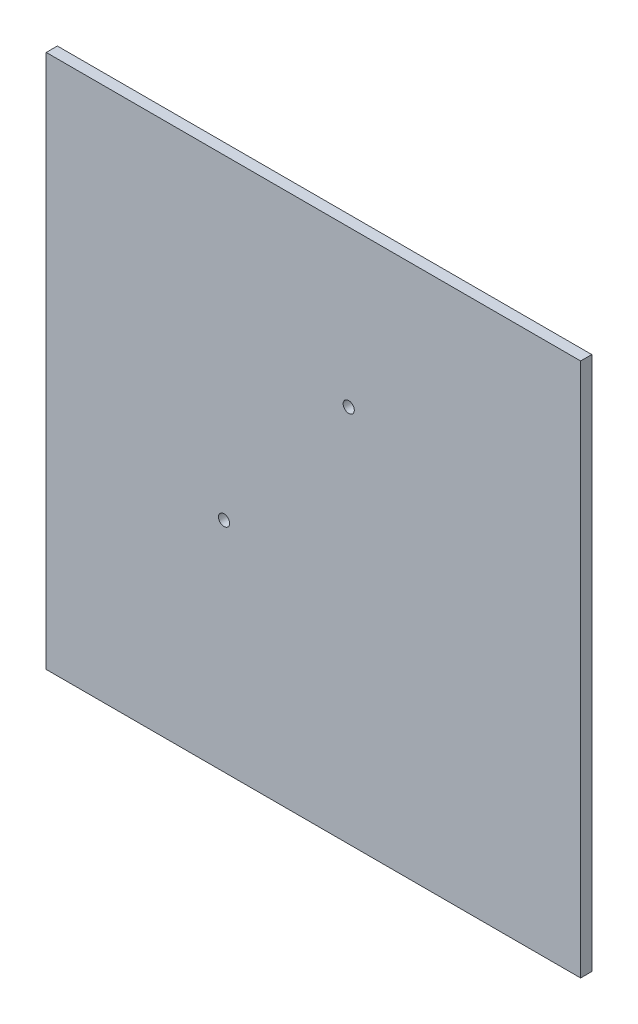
ISO-10303-21;
HEADER;
FILE_DESCRIPTION(('STEP AP214'),'2;1');
FILE_NAME('part.step','',(''),(''),'','','');
FILE_SCHEMA(('AUTOMOTIVE_DESIGN { 1 0 10303 214 1 1 1 1 }'));
ENDSEC;
DATA;
#1=APPLICATION_CONTEXT('core data for automotive mechanical design processes');
#2=APPLICATION_PROTOCOL_DEFINITION('international standard','automotive_design',2000,#1);
#3=PRODUCT_CONTEXT('',#1,'mechanical');
#4=PRODUCT('Part','Part','',(#3));
#5=PRODUCT_RELATED_PRODUCT_CATEGORY('part','',(#4));
#6=PRODUCT_DEFINITION_FORMATION('','',#4);
#7=PRODUCT_DEFINITION_CONTEXT('part definition',#1,'design');
#8=PRODUCT_DEFINITION('design','',#6,#7);
#9=PRODUCT_DEFINITION_SHAPE('','',#8);
#10=(LENGTH_UNIT() NAMED_UNIT(*) SI_UNIT(.MILLI.,.METRE.));
#11=(NAMED_UNIT(*) PLANE_ANGLE_UNIT() SI_UNIT($,.RADIAN.));
#12=(NAMED_UNIT(*) SI_UNIT($,.STERADIAN.) SOLID_ANGLE_UNIT());
#13=UNCERTAINTY_MEASURE_WITH_UNIT(LENGTH_MEASURE(1.E-05),#10,'distance_accuracy_value','');
#14=(GEOMETRIC_REPRESENTATION_CONTEXT(3) GLOBAL_UNCERTAINTY_ASSIGNED_CONTEXT((#13)) GLOBAL_UNIT_ASSIGNED_CONTEXT((#10,
#11,#12)) REPRESENTATION_CONTEXT('',''));
#15=CARTESIAN_POINT('',(0.,0.,0.));
#16=DIRECTION('',(0.,0.,1.));
#17=DIRECTION('',(1.,0.,0.));
#18=AXIS2_PLACEMENT_3D('',#15,#16,#17);
#19=CARTESIAN_POINT('',(0.,0.,3.175));
#20=DIRECTION('',(0.,0.,-1.));
#21=DIRECTION('',(-1.,0.,0.));
#22=AXIS2_PLACEMENT_3D('',#19,#20,#21);
#23=PLANE('',#22);
#24=DIRECTION('',(0.,-1.,0.));
#25=VECTOR('',#24,1.);
#26=CARTESIAN_POINT('',(0.,0.,3.175));
#27=LINE('',#26,#25);
#28=CARTESIAN_POINT('',(0.,152.4,3.175));
#29=VERTEX_POINT('',#28);
#30=CARTESIAN_POINT('',(0.,0.,3.175));
#31=VERTEX_POINT('',#30);
#32=EDGE_CURVE('E85',#29,#31,#27,.T.);
#33=ORIENTED_EDGE('',*,*,#32,.T.);
#34=DIRECTION('',(1.,0.,0.));
#35=VECTOR('',#34,1.);
#36=CARTESIAN_POINT('',(0.,0.,3.175));
#37=LINE('',#36,#35);
#38=CARTESIAN_POINT('',(152.4,0.,3.175));
#39=VERTEX_POINT('',#38);
#40=EDGE_CURVE('E80',#31,#39,#37,.T.);
#41=ORIENTED_EDGE('',*,*,#40,.T.);
#42=DIRECTION('',(0.,1.,0.));
#43=VECTOR('',#42,1.);
#44=CARTESIAN_POINT('',(152.4,0.,3.175));
#45=LINE('',#44,#43);
#46=CARTESIAN_POINT('',(152.4,152.4,3.175));
#47=VERTEX_POINT('',#46);
#48=EDGE_CURVE('E83',#39,#47,#45,.T.);
#49=ORIENTED_EDGE('',*,*,#48,.T.);
#50=DIRECTION('',(-1.,0.,0.));
#51=VECTOR('',#50,1.);
#52=CARTESIAN_POINT('',(0.,152.4,3.175));
#53=LINE('',#52,#51);
#54=EDGE_CURVE('E50',#47,#29,#53,.T.);
#55=ORIENTED_EDGE('',*,*,#54,.T.);
#56=EDGE_LOOP('',(#33,#41,#49,#55));
#57=FACE_BOUND('',#56,.T.);
#58=CARTESIAN_POINT('',(50.7041509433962,62.233423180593,3.175));
#59=DIRECTION('',(0.,0.,1.));
#60=DIRECTION('',(1.,0.,0.));
#61=AXIS2_PLACEMENT_3D('',#58,#59,#60);
#62=CIRCLE('',#61,1.5875);
#63=CARTESIAN_POINT('',(52.2916509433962,62.233423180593,3.175));
#64=VERTEX_POINT('',#63);
#65=EDGE_CURVE('E100',#64,#64,#62,.T.);
#66=ORIENTED_EDGE('',*,*,#65,.F.);
#67=EDGE_LOOP('',(#66));
#68=FACE_BOUND('',#67,.T.);
#69=CARTESIAN_POINT('',(86.2641509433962,107.953423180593,3.175));
#70=DIRECTION('',(0.,0.,1.));
#71=DIRECTION('',(1.,0.,0.));
#72=AXIS2_PLACEMENT_3D('',#69,#70,#71);
#73=CIRCLE('',#72,1.5875);
#74=CARTESIAN_POINT('',(87.8516509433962,107.953423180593,3.175));
#75=VERTEX_POINT('',#74);
#76=EDGE_CURVE('E115',#75,#75,#73,.T.);
#77=ORIENTED_EDGE('',*,*,#76,.F.);
#78=EDGE_LOOP('',(#77));
#79=FACE_BOUND('',#78,.T.);
#80=ADVANCED_FACE('F33',(#57,#68,#79),#23,.F.);
#81=CARTESIAN_POINT('',(0.,0.,0.));
#82=DIRECTION('',(0.,0.,-1.));
#83=DIRECTION('',(-1.,0.,0.));
#84=AXIS2_PLACEMENT_3D('',#81,#82,#83);
#85=PLANE('',#84);
#86=CARTESIAN_POINT('',(50.7041509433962,62.233423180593,0.));
#87=DIRECTION('',(0.,0.,1.));
#88=DIRECTION('',(1.,0.,0.));
#89=AXIS2_PLACEMENT_3D('',#86,#87,#88);
#90=CIRCLE('',#89,1.5875);
#91=CARTESIAN_POINT('',(52.2916509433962,62.233423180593,0.));
#92=VERTEX_POINT('',#91);
#93=EDGE_CURVE('E112',#92,#92,#90,.T.);
#94=ORIENTED_EDGE('',*,*,#93,.T.);
#95=EDGE_LOOP('',(#94));
#96=FACE_BOUND('',#95,.T.);
#97=DIRECTION('',(0.,-1.,0.));
#98=VECTOR('',#97,1.);
#99=CARTESIAN_POINT('',(0.,0.,0.));
#100=LINE('',#99,#98);
#101=CARTESIAN_POINT('',(0.,152.4,0.));
#102=VERTEX_POINT('',#101);
#103=CARTESIAN_POINT('',(0.,0.,0.));
#104=VERTEX_POINT('',#103);
#105=EDGE_CURVE('E97',#102,#104,#100,.T.);
#106=ORIENTED_EDGE('',*,*,#105,.F.);
#107=DIRECTION('',(-1.,0.,0.));
#108=VECTOR('',#107,1.);
#109=CARTESIAN_POINT('',(0.,152.4,0.));
#110=LINE('',#109,#108);
#111=CARTESIAN_POINT('',(152.4,152.4,0.));
#112=VERTEX_POINT('',#111);
#113=EDGE_CURVE('E73',#112,#102,#110,.T.);
#114=ORIENTED_EDGE('',*,*,#113,.F.);
#115=DIRECTION('',(0.,1.,0.));
#116=VECTOR('',#115,1.);
#117=CARTESIAN_POINT('',(152.4,0.,0.));
#118=LINE('',#117,#116);
#119=CARTESIAN_POINT('',(152.4,0.,0.));
#120=VERTEX_POINT('',#119);
#121=EDGE_CURVE('E67',#120,#112,#118,.T.);
#122=ORIENTED_EDGE('',*,*,#121,.F.);
#123=DIRECTION('',(1.,0.,0.));
#124=VECTOR('',#123,1.);
#125=CARTESIAN_POINT('',(0.,0.,0.));
#126=LINE('',#125,#124);
#127=EDGE_CURVE('E89',#104,#120,#126,.T.);
#128=ORIENTED_EDGE('',*,*,#127,.F.);
#129=EDGE_LOOP('',(#106,#114,#122,#128));
#130=FACE_BOUND('',#129,.T.);
#131=CARTESIAN_POINT('',(86.2641509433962,107.953423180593,0.));
#132=DIRECTION('',(0.,0.,1.));
#133=DIRECTION('',(1.,0.,0.));
#134=AXIS2_PLACEMENT_3D('',#131,#132,#133);
#135=CIRCLE('',#134,1.5875);
#136=CARTESIAN_POINT('',(87.8516509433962,107.953423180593,0.));
#137=VERTEX_POINT('',#136);
#138=EDGE_CURVE('E118',#137,#137,#135,.T.);
#139=ORIENTED_EDGE('',*,*,#138,.T.);
#140=EDGE_LOOP('',(#139));
#141=FACE_BOUND('',#140,.T.);
#142=ADVANCED_FACE('F108',(#96,#130,#141),#85,.T.);
#143=CARTESIAN_POINT('',(0.,0.,3.175));
#144=DIRECTION('',(1.,0.,0.));
#145=DIRECTION('',(0.,0.,-1.));
#146=AXIS2_PLACEMENT_3D('',#143,#144,#145);
#147=PLANE('',#146);
#148=ORIENTED_EDGE('',*,*,#105,.T.);
#149=DIRECTION('',(0.,0.,-1.));
#150=VECTOR('',#149,1.);
#151=CARTESIAN_POINT('',(0.,0.,3.175));
#152=LINE('',#151,#150);
#153=EDGE_CURVE('E11',#31,#104,#152,.T.);
#154=ORIENTED_EDGE('',*,*,#153,.F.);
#155=ORIENTED_EDGE('',*,*,#32,.F.);
#156=DIRECTION('',(0.,0.,-1.));
#157=VECTOR('',#156,1.);
#158=CARTESIAN_POINT('',(0.,152.4,3.175));
#159=LINE('',#158,#157);
#160=EDGE_CURVE('E93',#29,#102,#159,.T.);
#161=ORIENTED_EDGE('',*,*,#160,.T.);
#162=EDGE_LOOP('',(#148,#154,#155,#161));
#163=FACE_BOUND('',#162,.T.);
#164=ADVANCED_FACE('F35',(#163),#147,.F.);
#165=CARTESIAN_POINT('',(0.,0.,3.175));
#166=DIRECTION('',(0.,1.,0.));
#167=DIRECTION('',(0.,0.,1.));
#168=AXIS2_PLACEMENT_3D('',#165,#166,#167);
#169=PLANE('',#168);
#170=ORIENTED_EDGE('',*,*,#127,.T.);
#171=DIRECTION('',(0.,0.,-1.));
#172=VECTOR('',#171,1.);
#173=CARTESIAN_POINT('',(152.4,0.,3.175));
#174=LINE('',#173,#172);
#175=EDGE_CURVE('E42',#39,#120,#174,.T.);
#176=ORIENTED_EDGE('',*,*,#175,.F.);
#177=ORIENTED_EDGE('',*,*,#40,.F.);
#178=ORIENTED_EDGE('',*,*,#153,.T.);
#179=EDGE_LOOP('',(#170,#176,#177,#178));
#180=FACE_BOUND('',#179,.T.);
#181=ADVANCED_FACE('F88',(#180),#169,.F.);
#182=CARTESIAN_POINT('',(152.4,0.,3.175));
#183=DIRECTION('',(-1.,0.,0.));
#184=DIRECTION('',(0.,0.,1.));
#185=AXIS2_PLACEMENT_3D('',#182,#183,#184);
#186=PLANE('',#185);
#187=ORIENTED_EDGE('',*,*,#121,.T.);
#188=DIRECTION('',(0.,0.,-1.));
#189=VECTOR('',#188,1.);
#190=CARTESIAN_POINT('',(152.4,152.4,3.175));
#191=LINE('',#190,#189);
#192=EDGE_CURVE('E90',#47,#112,#191,.T.);
#193=ORIENTED_EDGE('',*,*,#192,.F.);
#194=ORIENTED_EDGE('',*,*,#48,.F.);
#195=ORIENTED_EDGE('',*,*,#175,.T.);
#196=EDGE_LOOP('',(#187,#193,#194,#195));
#197=FACE_BOUND('',#196,.T.);
#198=ADVANCED_FACE('F91',(#197),#186,.F.);
#199=CARTESIAN_POINT('',(0.,152.4,3.175));
#200=DIRECTION('',(0.,-1.,0.));
#201=DIRECTION('',(0.,0.,-1.));
#202=AXIS2_PLACEMENT_3D('',#199,#200,#201);
#203=PLANE('',#202);
#204=ORIENTED_EDGE('',*,*,#113,.T.);
#205=ORIENTED_EDGE('',*,*,#160,.F.);
#206=ORIENTED_EDGE('',*,*,#54,.F.);
#207=ORIENTED_EDGE('',*,*,#192,.T.);
#208=EDGE_LOOP('',(#204,#205,#206,#207));
#209=FACE_BOUND('',#208,.T.);
#210=ADVANCED_FACE('F105',(#209),#203,.F.);
#211=CARTESIAN_POINT('',(50.7041509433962,62.233423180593,3.175));
#212=DIRECTION('',(0.,0.,-1.));
#213=DIRECTION('',(-1.,0.,0.));
#214=AXIS2_PLACEMENT_3D('',#211,#212,#213);
#215=CYLINDRICAL_SURFACE('',#214,1.5875);
#216=ORIENTED_EDGE('',*,*,#65,.T.);
#217=EDGE_LOOP('',(#216));
#218=FACE_BOUND('',#217,.T.);
#219=ORIENTED_EDGE('',*,*,#93,.F.);
#220=EDGE_LOOP('',(#219));
#221=FACE_BOUND('',#220,.T.);
#222=ADVANCED_FACE('F135',(#218,#221),#215,.F.);
#223=CARTESIAN_POINT('',(86.2641509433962,107.953423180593,3.175));
#224=DIRECTION('',(0.,0.,-1.));
#225=DIRECTION('',(-1.,0.,0.));
#226=AXIS2_PLACEMENT_3D('',#223,#224,#225);
#227=CYLINDRICAL_SURFACE('',#226,1.5875);
#228=ORIENTED_EDGE('',*,*,#76,.T.);
#229=EDGE_LOOP('',(#228));
#230=FACE_BOUND('',#229,.T.);
#231=ORIENTED_EDGE('',*,*,#138,.F.);
#232=EDGE_LOOP('',(#231));
#233=FACE_BOUND('',#232,.T.);
#234=ADVANCED_FACE('F124',(#230,#233),#227,.F.);
#235=CLOSED_SHELL('',(#80,#142,#164,#181,#198,#210,#222,#234));
#236=MANIFOLD_SOLID_BREP('B2',#235);
#237=ADVANCED_BREP_SHAPE_REPRESENTATION('',(#18,#236),#14);
#238=SHAPE_DEFINITION_REPRESENTATION(#9,#237);
ENDSEC;
END-ISO-10303-21;
